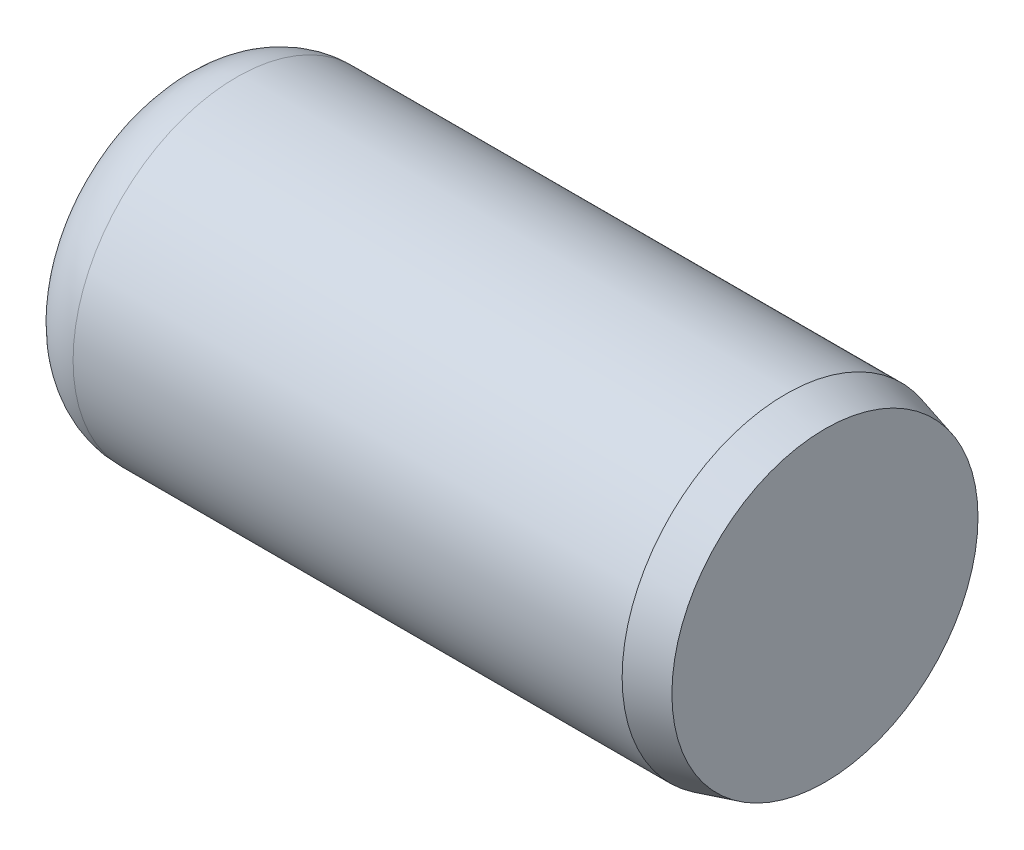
ISO-10303-21;
HEADER;
FILE_DESCRIPTION(('STEP AP214'),'2;1');
FILE_NAME('part.step','',(''),(''),'','','');
FILE_SCHEMA(('AUTOMOTIVE_DESIGN { 1 0 10303 214 1 1 1 1 }'));
ENDSEC;
DATA;
#1=APPLICATION_CONTEXT('core data for automotive mechanical design processes');
#2=APPLICATION_PROTOCOL_DEFINITION('international standard','automotive_design',2000,#1);
#3=PRODUCT_CONTEXT('',#1,'mechanical');
#4=PRODUCT('Part','Part','',(#3));
#5=PRODUCT_RELATED_PRODUCT_CATEGORY('part','',(#4));
#6=PRODUCT_DEFINITION_FORMATION('','',#4);
#7=PRODUCT_DEFINITION_CONTEXT('part definition',#1,'design');
#8=PRODUCT_DEFINITION('design','',#6,#7);
#9=PRODUCT_DEFINITION_SHAPE('','',#8);
#10=(LENGTH_UNIT() NAMED_UNIT(*) SI_UNIT(.MILLI.,.METRE.));
#11=(NAMED_UNIT(*) PLANE_ANGLE_UNIT() SI_UNIT($,.RADIAN.));
#12=(NAMED_UNIT(*) SI_UNIT($,.STERADIAN.) SOLID_ANGLE_UNIT());
#13=UNCERTAINTY_MEASURE_WITH_UNIT(LENGTH_MEASURE(1.E-05),#10,'distance_accuracy_value','');
#14=(GEOMETRIC_REPRESENTATION_CONTEXT(3) GLOBAL_UNCERTAINTY_ASSIGNED_CONTEXT((#13)) GLOBAL_UNIT_ASSIGNED_CONTEXT((#10,
#11,#12)) REPRESENTATION_CONTEXT('',''));
#15=CARTESIAN_POINT('',(0.,0.,0.));
#16=DIRECTION('',(0.,0.,1.));
#17=DIRECTION('',(1.,0.,0.));
#18=AXIS2_PLACEMENT_3D('',#15,#16,#17);
#19=CARTESIAN_POINT('',(12.7,0.,0.));
#20=DIRECTION('',(-1.,0.,0.));
#21=DIRECTION('',(0.,0.,1.));
#22=AXIS2_PLACEMENT_3D('',#19,#20,#21);
#23=PLANE('',#22);
#24=CARTESIAN_POINT('',(12.7000000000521,0.,0.));
#25=DIRECTION('',(-1.,0.,0.));
#26=DIRECTION('',(0.,0.,1.));
#27=AXIS2_PLACEMENT_3D('',#24,#25,#26);
#28=CIRCLE('',#27,2.9731993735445);
#29=CARTESIAN_POINT('',(12.7000000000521,0.,2.9731993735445));
#30=VERTEX_POINT('',#29);
#31=EDGE_CURVE('E42',#30,#30,#28,.T.);
#32=ORIENTED_EDGE('',*,*,#31,.F.);
#33=EDGE_LOOP('',(#32));
#34=FACE_BOUND('',#33,.T.);
#35=ADVANCED_FACE('F17',(#34),#23,.F.);
#36=CARTESIAN_POINT('',(0.,1.906524,0.));
#37=DIRECTION('',(1.,0.,0.));
#38=DIRECTION('',(0.,0.,-1.));
#39=AXIS2_PLACEMENT_3D('',#36,#37,#38);
#40=PLANE('',#39);
#41=CARTESIAN_POINT('',(0.,0.,0.));
#42=DIRECTION('',(1.,0.,0.));
#43=DIRECTION('',(0.,0.,1.));
#44=AXIS2_PLACEMENT_3D('',#41,#42,#43);
#45=CIRCLE('',#44,1.906524);
#46=CARTESIAN_POINT('',(0.,0.,1.906524));
#47=VERTEX_POINT('',#46);
#48=CARTESIAN_POINT('',(0.,0.,-1.906524));
#49=VERTEX_POINT('',#48);
#50=EDGE_CURVE('E34',#47,#49,#45,.T.);
#51=ORIENTED_EDGE('',*,*,#50,.F.);
#52=CARTESIAN_POINT('',(0.,0.,0.));
#53=DIRECTION('',(1.,0.,0.));
#54=DIRECTION('',(0.,0.,-1.));
#55=AXIS2_PLACEMENT_3D('',#52,#53,#54);
#56=CIRCLE('',#55,1.906524);
#57=EDGE_CURVE('E40',#49,#47,#56,.T.);
#58=ORIENTED_EDGE('',*,*,#57,.F.);
#59=EDGE_LOOP('',(#51,#58));
#60=FACE_BOUND('',#59,.T.);
#61=ADVANCED_FACE('F45',(#60),#40,.F.);
#62=CARTESIAN_POINT('',(11.937390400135,0.,0.));
#63=DIRECTION('',(-1.,0.,0.));
#64=DIRECTION('',(0.,0.,1.));
#65=AXIS2_PLACEMENT_3D('',#62,#63,#64);
#66=CONICAL_SURFACE('',#65,3.17753999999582,0.26179938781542);
#67=CARTESIAN_POINT('',(11.9373904,0.,0.));
#68=DIRECTION('',(-1.,0.,0.));
#69=DIRECTION('',(0.,0.,1.));
#70=AXIS2_PLACEMENT_3D('',#67,#68,#69);
#71=CIRCLE('',#70,3.17754);
#72=CARTESIAN_POINT('',(11.9373904,0.,3.17754));
#73=VERTEX_POINT('',#72);
#74=EDGE_CURVE('E27',#73,#73,#71,.T.);
#75=ORIENTED_EDGE('',*,*,#74,.F.);
#76=EDGE_LOOP('',(#75));
#77=FACE_BOUND('',#76,.T.);
#78=ORIENTED_EDGE('',*,*,#31,.T.);
#79=EDGE_LOOP('',(#78));
#80=FACE_BOUND('',#79,.T.);
#81=ADVANCED_FACE('F61',(#77,#80),#66,.T.);
#82=CARTESIAN_POINT('',(1.271016,0.,0.));
#83=DIRECTION('',(-1.,0.,0.));
#84=DIRECTION('',(0.,0.,1.));
#85=AXIS2_PLACEMENT_3D('',#82,#83,#84);
#86=TOROIDAL_SURFACE('',#85,1.906524,1.271016);
#87=ORIENTED_EDGE('',*,*,#50,.T.);
#88=ORIENTED_EDGE('',*,*,#57,.T.);
#89=EDGE_LOOP('',(#87,#88));
#90=FACE_BOUND('',#89,.T.);
#91=CARTESIAN_POINT('',(1.271016,0.,0.));
#92=DIRECTION('',(-1.,0.,0.));
#93=DIRECTION('',(0.,0.,1.));
#94=AXIS2_PLACEMENT_3D('',#91,#92,#93);
#95=CIRCLE('',#94,3.17754);
#96=CARTESIAN_POINT('',(1.271016,0.,3.17754));
#97=VERTEX_POINT('',#96);
#98=EDGE_CURVE('E11',#97,#97,#95,.F.);
#99=ORIENTED_EDGE('',*,*,#98,.F.);
#100=EDGE_LOOP('',(#99));
#101=FACE_BOUND('',#100,.T.);
#102=ADVANCED_FACE('F38',(#90,#101),#86,.T.);
#103=CARTESIAN_POINT('',(-6.35,0.,0.));
#104=DIRECTION('',(-1.,0.,0.));
#105=DIRECTION('',(0.,0.,1.));
#106=AXIS2_PLACEMENT_3D('',#103,#104,#105);
#107=CYLINDRICAL_SURFACE('',#106,3.17754);
#108=ORIENTED_EDGE('',*,*,#98,.T.);
#109=EDGE_LOOP('',(#108));
#110=FACE_BOUND('',#109,.T.);
#111=ORIENTED_EDGE('',*,*,#74,.T.);
#112=EDGE_LOOP('',(#111));
#113=FACE_BOUND('',#112,.T.);
#114=ADVANCED_FACE('F69',(#110,#113),#107,.T.);
#115=CLOSED_SHELL('',(#35,#61,#81,#102,#114));
#116=MANIFOLD_SOLID_BREP('B1',#115);
#117=ADVANCED_BREP_SHAPE_REPRESENTATION('',(#18,#116),#14);
#118=SHAPE_DEFINITION_REPRESENTATION(#9,#117);
ENDSEC;
END-ISO-10303-21;
